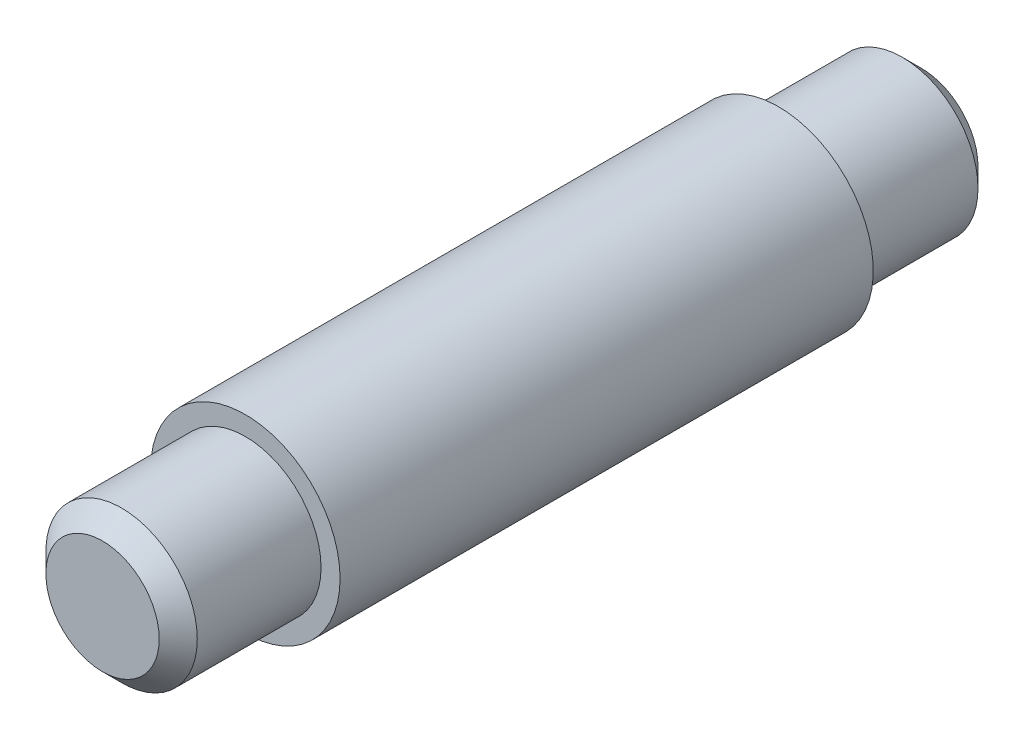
from build123d import *

# Parameters (mm, degrees)
SKETCH1_R           = 9.95
BOSS_EXTRUDE1_DEPTH = 43
SKETCH2_R           = 9.95
SKETCH2_R_2         = 7.95
CUT_EXTRUDE1_DEPTH  = 15
CUT_EXTRUDE2_START  = -15
SKETCH3_R           = 9.95
SKETCH3_R_2         = 7.95
CUT_EXTRUDE2_DEPTH  = 15
CHAMFER1_SIZE       = 2


with BuildPart() as part:
    # Sketch1 → Boss-Extrude1 (new, symmetric)
    with BuildSketch(Plane.XY):
        Circle(SKETCH1_R)
    extrude(amount=BOSS_EXTRUDE1_DEPTH, both=True)

    # Sketch2 → Cut-Extrude1 (cut)
    with BuildSketch(Plane.XY.offset(43)):
        Circle(SKETCH2_R)
        Circle(SKETCH2_R_2, mode=Mode.SUBTRACT)
    extrude(amount=-CUT_EXTRUDE1_DEPTH, mode=Mode.SUBTRACT)

    # Sketch3 → Cut-Extrude2 (cut)
    with BuildSketch(Plane(origin=(0, 0, -43), x_dir=(-1, 0, 0), z_dir=(0, 0, -1)).offset(CUT_EXTRUDE2_START)):
        Circle(SKETCH3_R)
        with Locations(Location((0, 0, 0), (0, 0, 180))):
            Circle(SKETCH3_R_2, mode=Mode.SUBTRACT)
    extrude(amount=CUT_EXTRUDE2_DEPTH, mode=Mode.SUBTRACT)

    # Chamfer1
    chamfer1_edges = [part.edges().sort_by_distance(p)[0] for p in [
        (-7.95, 0, -43),
        (-7.95, 0, 43),
    ]]
    chamfer(chamfer1_edges, length=CHAMFER1_SIZE)


solid = part.part
